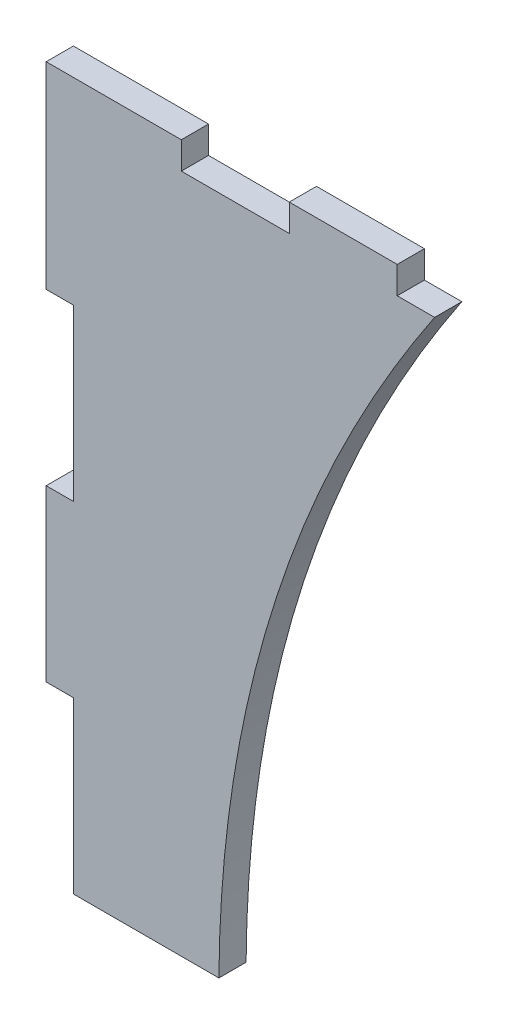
from build123d import *

# Parameters (mm, degrees)
BOSS_EXTRUDE1_DEPTH = 16


with BuildPart() as part:
    # Sketch2 → Boss-Extrude1 (new body)
    with BuildSketch(Plane.XY):
        with BuildLine():
            Line((0, 200), (0, 100))
            Line((0, 100), (16, 100))
            Line((16, 100), (16, 0))
            Line((16, 0), (101.6, 0))
            add(Edge.make_bspline(
                [(228.5, 400), (103.225203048, 213.725277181), (101.6, 0)],
                knots=[0, 0, 0, 0.978671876, 0.978671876, 0.978671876], degree=2))
            Line((228.5, 400), (206.5, 400))
            Line((206.5, 400), (206.5, 416))
            Line((206.5, 416), (143, 416))
            Line((143, 416), (143, 400))
            Line((143, 400), (79.5, 400))
            Line((79.5, 400), (79.5, 416))
            Line((79.5, 416), (16, 416))
            Line((16, 416), (0, 416))
            Line((0, 416), (0, 400))
            Line((0, 400), (0, 300))
            Line((0, 300), (16, 300))
            Line((16, 300), (16, 200))
            Line((16, 200), (0, 200))
        make_face()
    extrude(amount=BOSS_EXTRUDE1_DEPTH)


solid = part.part
